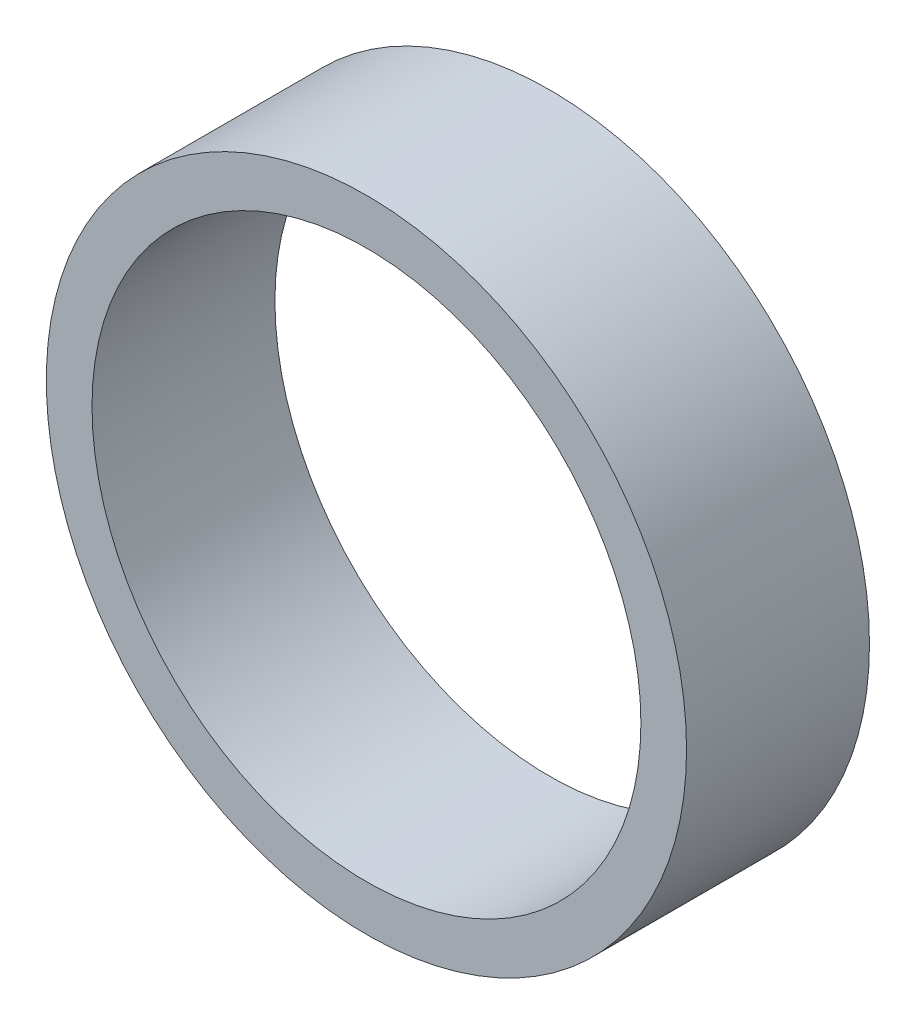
from build123d import *

# Parameters (mm, degrees)
SKETCH1_R           = 133.35
BOSS_EXTRUDE1_DEPTH = 76.2
SKETCH2_R           = 114.3254
CUT_EXTRUDE1_DEPTH  = 76.2


with BuildPart() as part:
    # Sketch1 → Boss-Extrude1 (new body)
    with BuildSketch(Plane.XY):
        Circle(SKETCH1_R)
    extrude(amount=BOSS_EXTRUDE1_DEPTH)

    # Sketch2 → Cut-Extrude1 (cut)
    with BuildSketch(Plane.XY):
        Circle(SKETCH2_R)
    extrude(amount=CUT_EXTRUDE1_DEPTH, mode=Mode.SUBTRACT)


solid = part.part
